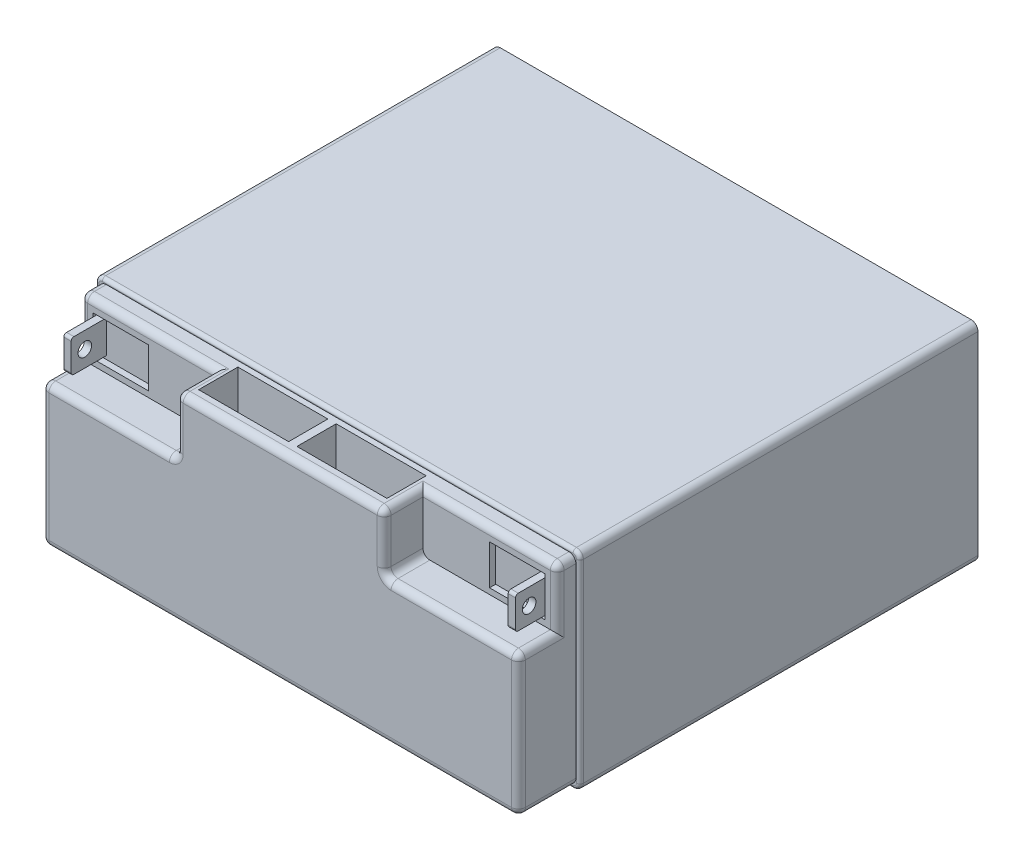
from build123d import *

# Parameters (mm, degrees)
SKETCH1_W                    = 177.8
SKETCH1_H                    = 146.05
BOSS_EXTRUDE1_DEPTH          = 76.2
SKETCH2_W                    = 174.845239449
SKETCH2_H                    = 73.245239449
BOSS_EXTRUDE2_DEPTH          = 21.082
SKETCH3_W                    = 14.224
SKETCH3_H                    = 21.336
CUT_EXTRUDE1_DEPTH           = 49.276
SKETCH4_W                    = 2.693561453
SKETCH4_H                    = 12
BOSS_EXTRUDE3_DEPTH          = 10.746
CUT_EXTRUDE2_DEPTH           = 2.254
SKETCH6_W                    = 49.276
SKETCH6_H                    = 14.224
CUT_EXTRUDE3_DEPTH           = 21.336
SKETCH7_W                    = 2.693561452
SKETCH7_H                    = 12
BOSS_EXTRUDE4_DEPTH          = 10.746
CUT_EXTRUDE4_DEPTH           = 2.254
SKETCH9_W                    = 33.02
SKETCH9_H                    = 14.399652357
CUT_EXTRUDE5_DEPTH           = 19.05
SKETCH10_W                   = 33.02
SKETCH10_H                   = 14.399652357
CUT_EXTRUDE6_DEPTH           = 19.05
SKETCH11_W                   = 63.5
SKETCH11_H                   = 15.201284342
CUT_EXTRUDE7_DEPTH           = 19.558
SKETCH12_W                   = 63.5
SKETCH12_H                   = 15.201284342
CUT_EXTRUDE8_DEPTH           = 19.558
F_5_0_5_DIAMETER_HOLE1_D     = 5
F_5_0_5_DIAMETER_HOLE1_DEPTH = 8.734014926
F_5_0_5_DIAMETER_HOLE2_D     = 5
F_5_0_5_DIAMETER_HOLE2_DEPTH = 8.734014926
FILLET1_R                    = 2.54
FILLET2_R                    = 1
FILLET3_R                    = 1.27


with BuildPart() as part:
    # Sketch1 → Boss-Extrude1 (new body)
    with BuildSketch(Plane.XZ.offset(62.213215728)):
        with Locations((55.786931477, 73.025)):
            Rectangle(SKETCH1_W, SKETCH1_H)
    extrude(amount=-BOSS_EXTRUDE1_DEPTH)

    # Sketch2 → Boss-Extrude2 (add)
    with BuildSketch(Plane.XY.offset(146.05)):
        with Locations((55.786931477, -24.113215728)):
            Rectangle(SKETCH2_W, SKETCH2_H)
    extrude(amount=BOSS_EXTRUDE2_DEPTH)

    # Sketch3 → Cut-Extrude1 (cut)
    with BuildSketch(Plane.ZY.offset(31.635688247)):
        with Locations((160.02, 1.841403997)):
            Rectangle(SKETCH3_W, SKETCH3_H)
    extrude(amount=-CUT_EXTRUDE1_DEPTH, mode=Mode.SUBTRACT)

    # Sketch4 → Boss-Extrude3 (add)
    with BuildSketch(Plane.XY.offset(152.908)):
        with Locations((-25.725834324, 0.632623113)):
            Rectangle(SKETCH4_W, SKETCH4_H)
    extrude(amount=BOSS_EXTRUDE3_DEPTH)

    # Sketch5 → Cut-Extrude2 (cut)
    with BuildSketch(Plane.XY.offset(152.908)):
        Polygon((-27.07261505, 6.632623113), (-24.379053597, 6.632623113), (-24.379053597, -5.367376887), (-27.07261505, -5.367376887), (-27.07261505, -6.677584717), (-6.787176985, -6.677584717), (-6.787176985, 7.942830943), (-27.07261505, 7.942830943), align=None)
    extrude(amount=-CUT_EXTRUDE2_DEPTH, mode=Mode.SUBTRACT)

    # Sketch6 → Cut-Extrude3 (cut)
    with BuildSketch(Plane(origin=(0, 12.509403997, 0), x_dir=(-1, 0, 0), z_dir=(0, 1, 0))):
        with Locations((-118.571551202, 160.02)):
            Rectangle(SKETCH6_W, SKETCH6_H)
    extrude(amount=-CUT_EXTRUDE3_DEPTH, mode=Mode.SUBTRACT)

    # Sketch7 → Boss-Extrude4 (add)
    with BuildSketch(Plane.XY.offset(152.908)):
        with Locations((137.299697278, 0.632623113)):
            Rectangle(SKETCH7_W, SKETCH7_H)
    extrude(amount=BOSS_EXTRUDE4_DEPTH)

    # Sketch8 → Cut-Extrude4 (cut)
    with BuildSketch(Plane.XY.offset(152.908)):
        Polygon((138.646478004, -5.367376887), (135.952916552, -5.367376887), (135.952916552, 6.632623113), (138.646478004, 6.632623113), (138.646478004, 7.942830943), (118.361039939, 7.942830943), (118.361039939, -6.677584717), (138.646478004, -6.677584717), align=None)
    extrude(amount=-CUT_EXTRUDE4_DEPTH, mode=Mode.SUBTRACT)

    # Sketch9 → Cut-Extrude5 (cut)
    with BuildSketch(Plane(origin=(0, 12.509403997, 0), x_dir=(-1, 0, 0), z_dir=(0, 1, 0))):
        with Locations((-73.820931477, 155.313650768)):
            Rectangle(SKETCH9_W, SKETCH9_H)
    extrude(amount=-CUT_EXTRUDE5_DEPTH, mode=Mode.SUBTRACT)

    # Sketch10 → Cut-Extrude6 (cut)
    with BuildSketch(Plane(origin=(0, 12.509403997, 0), x_dir=(-1, 0, 0), z_dir=(0, 1, 0))):
        with Locations((-37.752931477, 155.313650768)):
            Rectangle(SKETCH10_W, SKETCH10_H)
    extrude(amount=-CUT_EXTRUDE6_DEPTH, mode=Mode.SUBTRACT)

    # Sketch11 → Cut-Extrude7 (cut)
    with BuildSketch(Plane.XZ.offset(60.735835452)):
        with Locations((88.599551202, 155.2427389)):
            Rectangle(SKETCH11_W, SKETCH11_H)
    extrude(amount=-CUT_EXTRUDE7_DEPTH, mode=Mode.SUBTRACT)

    # Sketch12 → Cut-Extrude8 (cut)
    with BuildSketch(Plane.XZ.offset(60.735835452)):
        with Locations((22.974311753, 155.2427389)):
            Rectangle(SKETCH12_W, SKETCH12_H)
    extrude(amount=-CUT_EXTRUDE8_DEPTH, mode=Mode.SUBTRACT)

    # 5.0 _5_ Diameter Hole1
    with Locations(Plane.ZY.offset(-135.952916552)):
        with Locations((158.654, 0.632623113)):
            Hole(F_5_0_5_DIAMETER_HOLE1_D / 2, depth=F_5_0_5_DIAMETER_HOLE1_DEPTH)

    # 5.0 _5_ Diameter Hole2
    with Locations(Plane(origin=(-24.379053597, 0, 0), x_dir=(0, 0, -1), z_dir=(1, 0, 0))):
        with Locations((-158.654, 0.632623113)):
            Hole(F_5_0_5_DIAMETER_HOLE2_D / 2, depth=F_5_0_5_DIAMETER_HOLE2_DEPTH)

    # Fillet1
    fillet1_edges = [part.edges().sort_by_distance(p)[0] for p in [
        (144.686931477, 13.986784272, 73.025),
        (143.209551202, -60.735835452, 156.591),
        (-31.635688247, -60.735835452, 156.591),
        (143.209551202, -34.781215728, 167.132),
        (55.786931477, -60.735835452, 167.132),
        (-31.635688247, -34.781215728, 167.132),
        (-31.635688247, 12.509403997, 149.479),
        (17.640311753, 12.509403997, 160.02),
        (-6.997688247, 12.509403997, 152.908),
        (17.640311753, 1.841403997, 167.132),
        (17.640311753, -8.826596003, 160.02),
        (-6.997688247, -8.826596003, 167.132),
        (-31.635688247, 1.841403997, 152.908),
        (-31.635688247, -8.826596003, 160.02),
        (-33.113068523, 13.986784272, 73.025),
        (144.686931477, -62.213215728, 73.025),
        (-33.113068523, -62.213215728, 73.025),
        (55.786931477, 12.509403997, 167.132),
        (143.209551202, 12.509403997, 149.479),
        (143.209551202, -8.826596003, 160.02),
        (143.209551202, 1.841403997, 152.908),
        (118.571551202, -8.826596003, 167.132),
        (93.933551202, -8.826596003, 160.02),
        (93.933551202, 1.841403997, 167.132),
        (118.571551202, 12.509403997, 152.908),
        (93.933551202, 12.509403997, 160.02),
    ]]
    fillet(fillet1_edges, radius=FILLET1_R)

    # Fillet2
    fillet2_edges = [part.edges().sort_by_distance(p)[0] for p in [
        (-25.725834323, 6.632623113, 163.654),
        (-25.725834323, -5.367376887, 163.654),
        (137.299697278, 6.632623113, 163.654),
        (137.299697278, -5.367376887, 163.654),
    ]]
    fillet(fillet2_edges, radius=FILLET2_R)

    # Fillet3
    fillet3_edges = [part.edges().sort_by_distance(p)[0] for p in [
        (-33.113068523, -24.113215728, 146.05),
        (55.786931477, 13.986784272, 146.05),
        (55.786931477, -62.213215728, 146.05),
        (144.686931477, -24.113215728, 146.05),
        (143.942982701, 13.242835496, 146.05),
        (-32.369119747, -61.469266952, 146.05),
        (143.942982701, -61.469266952, 146.05),
        (-32.369119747, 13.242835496, 146.05),
    ]]
    fillet(fillet3_edges, radius=FILLET3_R)


solid = part.part
